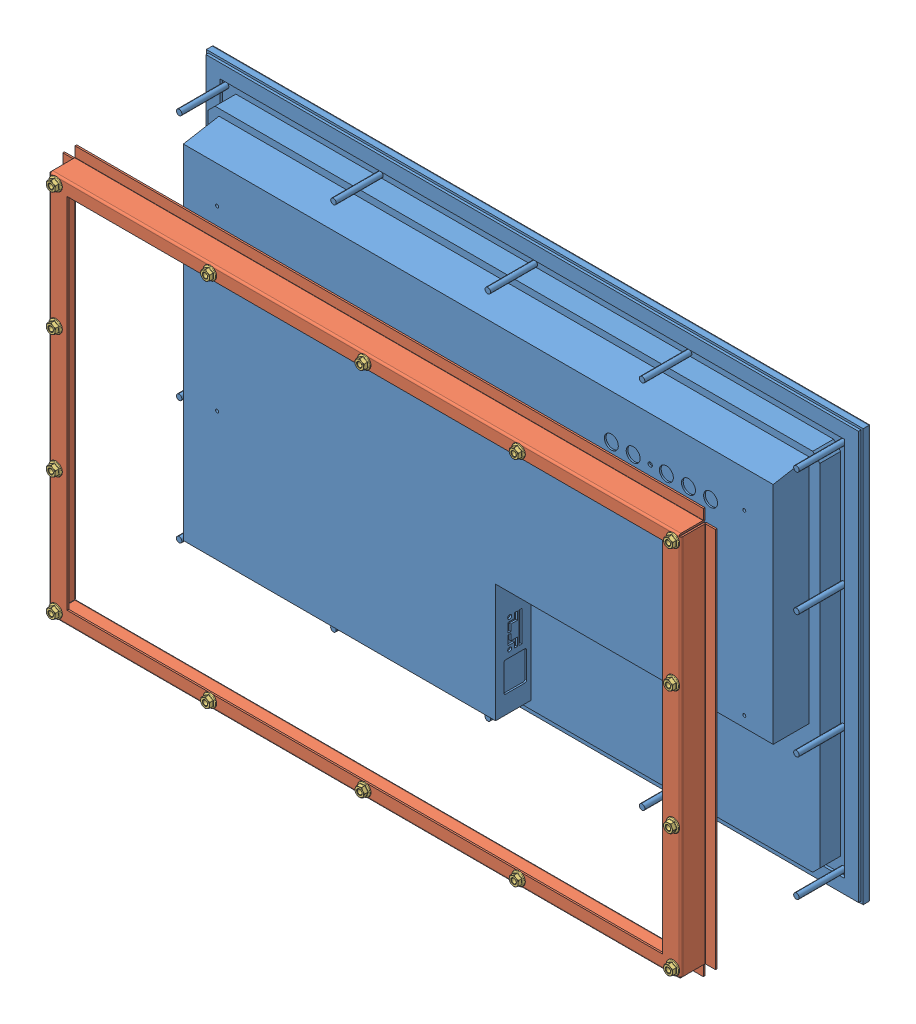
SolidWorks assembly 23 inch Panel Mount Monitor, HIS-ML23-xxxC.SLDASM, configuration Default (file format 10000). Lengths in mm.
Overall size (596.9 374.65 166.53).
16 component instances, 3 part files, 30 mates.
Components (placement in the parent):
- Monitor, 23C-2: Monitor, 23C.sldprt [Default] at origin size (596.9 374.65 58.45)
- Collar, 10914-1: Collar, 10914.sldprt [Default] at (0.0254 0 152.9036) size (593.09 368.45 23.57)
- M5 Nut, 30008-1: M5 Nut, 30008.sldprt [M5 Nut - 30008] at (-280.4668 168.1226 159.4225) size (11.8 11.8 5)
- M5 Nut, 30008-2: M5 Nut, 30008.sldprt [M5 Nut - 30008] at (-140.2334 168.1226 159.4225) x (-1 0 0) z (0 0 1) size (11.8 11.8 5)
- M5 Nut, 30008-3: M5 Nut, 30008.sldprt [M5 Nut - 30008] at (0 168.1226 159.4225) size (11.8 11.8 5)
- M5 Nut, 30008-4: M5 Nut, 30008.sldprt [M5 Nut - 30008] at (140.2334 168.1226 159.4225) size (11.8 11.8 5)
- M5 Nut, 30008-5: M5 Nut, 30008.sldprt [M5 Nut - 30008] at (280.4668 168.1226 159.4225) size (11.8 11.8 5)
- M5 Nut, 30008-6: M5 Nut, 30008.sldprt [M5 Nut - 30008] at (280.4668 56.0324 159.4225) size (11.8 11.8 5)
- M5 Nut, 30008-7: M5 Nut, 30008.sldprt [M5 Nut - 30008] at (280.4668 -56.0578 159.4225) x (0 -1 0) z (0 0 1) size (11.8 11.8 5)
- M5 Nut, 30008-8: M5 Nut, 30008.sldprt [M5 Nut - 30008] at (280.4668 -168.148 159.4225) size (11.8 11.8 5)
- M5 Nut, 30008-9: M5 Nut, 30008.sldprt [M5 Nut - 30008] at (140.2334 -168.148 159.4225) size (11.8 11.8 5)
- M5 Nut, 30008-10: M5 Nut, 30008.sldprt [M5 Nut - 30008] at (0 -168.148 159.4225) x (0.923728 -0.383049 0) z (0 0 1) size (11.8 11.8 5)
- M5 Nut, 30008-11: M5 Nut, 30008.sldprt [M5 Nut - 30008] at (-140.2334 -168.148 159.4225) size (11.8 11.8 5)
- M5 Nut, 30008-12: M5 Nut, 30008.sldprt [M5 Nut - 30008] at (-280.4668 -168.148 159.4225) size (11.8 11.8 5)
- M5 Nut, 30008-13: M5 Nut, 30008.sldprt [M5 Nut - 30008] at (-280.4668 -56.0578 159.4225) size (11.8 11.8 5)
- M5 Nut, 30008-14: M5 Nut, 30008.sldprt [M5 Nut - 30008] at (-280.4668 56.0324 159.4225) size (11.8 11.8 5)
Mates (geometry in assembly coordinates):
- Concentric1: concentric anti-aligned: cylinder of Monitor, 23C-2 through (280.4668 168.1226 42.7) axis (0 0 -1) radius 2.5; cylinder of Collar, 10914-1 through (280.4668 168.1226 154.4225) axis (0 0 1) radius 3.175
- Parallel1: parallel anti-aligned: line of Monitor, 23C-2 through (596.9 298.45 187.325) axis (0 -1 0); line of Collar, 10914-1 through (-285.4688 184.2262 132.3702) axis (1 0 0)
- Concentric21: concentric aligned: cylinder of Collar, 10914-1 through (-280.4668 168.1226 154.4225) axis (0 0 1) radius 3.175; cylinder of M5 Nut, 30008-1 through (-280.4668 168.1226 134.385) axis (0 0 1) radius 2.5
- Coincident11: coincident anti-aligned: plane of Collar, 10914-1 through (0.0254 0 154.4225) normal (0 0 1); plane of M5 Nut, 30008-1 through (-280.4668 172.7414 154.4225) normal (0 0 -1)
- Concentric31: concentric aligned: cylinder of Collar, 10914-1 through (-140.2334 168.1226 154.4225) axis (0 0 1) radius 3.175; cylinder of M5 Nut, 30008-2 through (-140.2334 168.1226 134.385) axis (0 0 1) radius 2.5
- Coincident21: coincident anti-aligned: plane of Collar, 10914-1 through (0.0254 0 154.4225) normal (0 0 1); plane of M5 Nut, 30008-2 through (-140.2334 163.5038 154.4225) normal (0 0 -1)
- Concentric41: concentric aligned: cylinder of Collar, 10914-1 through (0 168.1226 154.4225) axis (0 0 1) radius 3.175; cylinder of M5 Nut, 30008-3 through (0 168.1226 134.385) axis (0 0 1) radius 2.5
- Coincident31: coincident anti-aligned: plane of Collar, 10914-1 through (0.0254 0 154.4225) normal (0 0 1); plane of M5 Nut, 30008-3 through (0 172.7414 154.4225) normal (0 0 -1)
- Concentric51: concentric aligned: cylinder of Collar, 10914-1 through (140.2334 168.1226 154.4225) axis (0 0 1) radius 3.175; cylinder of M5 Nut, 30008-4 through (140.2334 168.1226 134.385) axis (0 0 1) radius 2.5
- Coincident41: coincident anti-aligned: plane of Collar, 10914-1 through (0.0254 0 154.4225) normal (0 0 1); plane of M5 Nut, 30008-4 through (140.2334 172.7414 154.4225) normal (0 0 -1)
- Concentric61: concentric aligned: cylinder of Collar, 10914-1 through (280.4668 168.1226 154.4225) axis (0 0 1) radius 3.175; cylinder of M5 Nut, 30008-5 through (280.4668 168.1226 134.385) axis (0 0 1) radius 2.5
- Coincident51: coincident anti-aligned: plane of Collar, 10914-1 through (0.0254 0 154.4225) normal (0 0 1); plane of M5 Nut, 30008-5 through (280.4668 172.7414 154.4225) normal (0 0 -1)
- Concentric71: concentric aligned: cylinder of Collar, 10914-1 through (280.4668 56.0324 154.4225) axis (0 0 1) radius 3.175; cylinder of M5 Nut, 30008-6 through (280.4668 56.0324 134.385) axis (0 0 1) radius 2.5
- Coincident61: coincident anti-aligned: plane of Collar, 10914-1 through (0.0254 0 154.4225) normal (0 0 1); plane of M5 Nut, 30008-6 through (280.4668 60.6512 154.4225) normal (0 0 -1)
- Concentric81: concentric aligned: cylinder of Collar, 10914-1 through (280.4668 -56.0578 154.4225) axis (0 0 1) radius 3.175; cylinder of M5 Nut, 30008-7 through (280.4668 -56.0578 134.385) axis (0 0 1) radius 2.5
- Coincident71: coincident anti-aligned: plane of Collar, 10914-1 through (0.0254 0 154.4225) normal (0 0 1); plane of M5 Nut, 30008-7 through (285.0856 -56.0578 154.4225) normal (0 0 -1)
- Concentric91: concentric aligned: cylinder of Collar, 10914-1 through (280.4668 -168.148 154.4225) axis (0 0 1) radius 3.175; cylinder of M5 Nut, 30008-8 through (280.4668 -168.148 134.385) axis (0 0 1) radius 2.5
- Coincident81: coincident anti-aligned: plane of Collar, 10914-1 through (0.0254 0 154.4225) normal (0 0 1); plane of M5 Nut, 30008-8 through (280.4668 -163.5292 154.4225) normal (0 0 -1)
- Concentric101: concentric aligned: cylinder of Collar, 10914-1 through (140.2334 -168.148 154.4225) axis (0 0 1) radius 3.175; cylinder of M5 Nut, 30008-9 through (140.2334 -168.148 134.385) axis (0 0 1) radius 2.5
- Coincident91: coincident anti-aligned: plane of Collar, 10914-1 through (0.0254 0 154.4225) normal (0 0 1); plane of M5 Nut, 30008-9 through (140.2334 -163.5292 154.4225) normal (0 0 -1)
- Concentric111: concentric aligned: cylinder of Collar, 10914-1 through (0 -168.148 154.4225) axis (0 0 1) radius 3.175; cylinder of M5 Nut, 30008-10 through (0 -168.148 134.385) axis (0 0 1) radius 2.5
- Coincident101: coincident anti-aligned: plane of Collar, 10914-1 through (0.0254 0 154.4225) normal (0 0 1); plane of M5 Nut, 30008-10 through (1.7692 -163.8815 154.4225) normal (0 0 -1)
- Concentric121: concentric aligned: cylinder of Collar, 10914-1 through (-140.2334 -168.148 154.4225) axis (0 0 1) radius 3.175; cylinder of M5 Nut, 30008-11 through (-140.2334 -168.148 134.385) axis (0 0 1) radius 2.5
- Coincident111: coincident anti-aligned: plane of Collar, 10914-1 through (0.0254 0 154.4225) normal (0 0 1); plane of M5 Nut, 30008-11 through (-140.2334 -163.5292 154.4225) normal (0 0 -1)
- Concentric131: concentric aligned: cylinder of Collar, 10914-1 through (-280.4668 -168.148 154.4225) axis (0 0 1) radius 3.175; cylinder of M5 Nut, 30008-12 through (-280.4668 -168.148 134.385) axis (0 0 1) radius 2.5
- Coincident121: coincident anti-aligned: plane of Collar, 10914-1 through (0.0254 0 154.4225) normal (0 0 1); plane of M5 Nut, 30008-12 through (-280.4668 -163.5292 154.4225) normal (0 0 -1)
- Concentric141: concentric aligned: cylinder of Collar, 10914-1 through (-280.4668 -56.0578 154.4225) axis (0 0 1) radius 3.175; cylinder of M5 Nut, 30008-13 through (-280.4668 -56.0578 134.385) axis (0 0 1) radius 2.5
- Coincident131: coincident anti-aligned: plane of Collar, 10914-1 through (0.0254 0 154.4225) normal (0 0 1); plane of M5 Nut, 30008-13 through (-280.4668 -51.439 154.4225) normal (0 0 -1)
- Concentric151: concentric aligned: cylinder of Collar, 10914-1 through (-280.4668 56.0324 154.4225) axis (0 0 1) radius 3.175; cylinder of M5 Nut, 30008-14 through (-280.4668 56.0324 134.385) axis (0 0 1) radius 2.5
- Coincident141: coincident anti-aligned: plane of Collar, 10914-1 through (0.0254 0 154.4225) normal (0 0 1); plane of M5 Nut, 30008-14 through (-280.4668 60.6512 154.4225) normal (0 0 -1)
